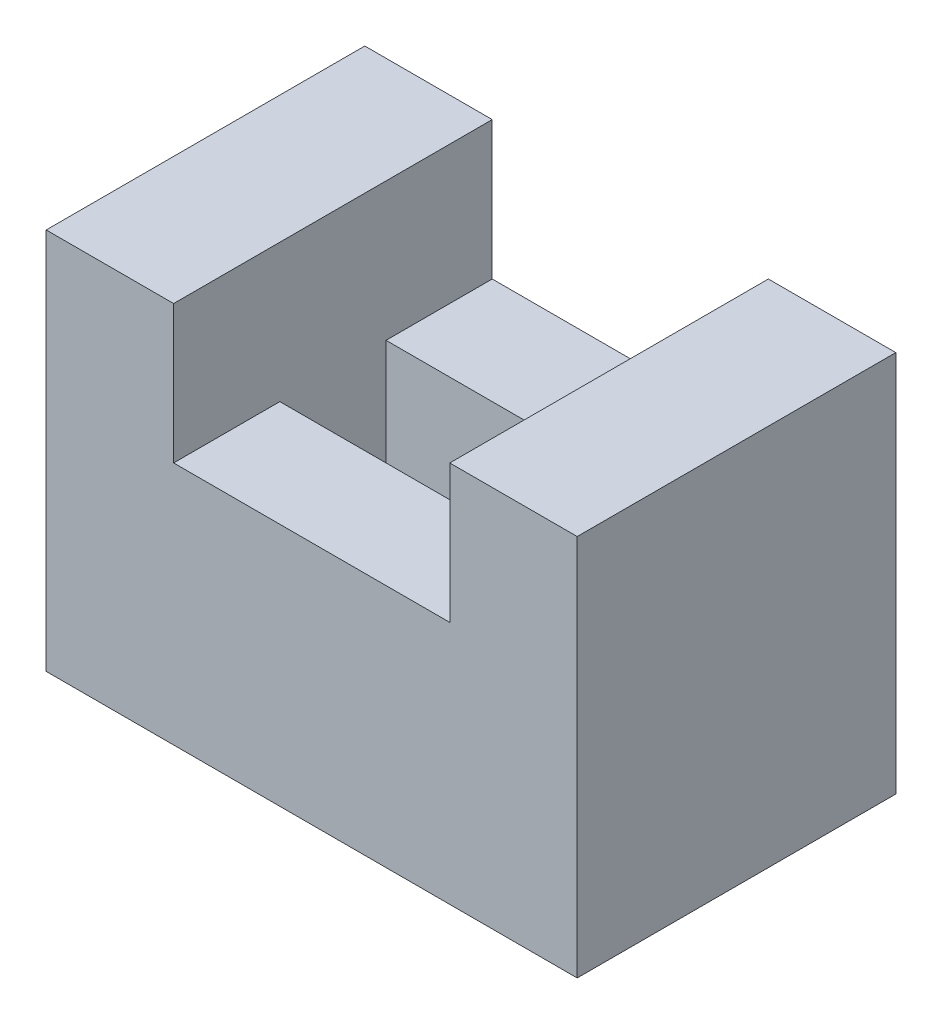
ISO-10303-21;
HEADER;
FILE_DESCRIPTION(('STEP AP214'),'2;1');
FILE_NAME('part.step','',(''),(''),'','','');
FILE_SCHEMA(('AUTOMOTIVE_DESIGN { 1 0 10303 214 1 1 1 1 }'));
ENDSEC;
DATA;
#1=APPLICATION_CONTEXT('core data for automotive mechanical design processes');
#2=APPLICATION_PROTOCOL_DEFINITION('international standard','automotive_design',2000,#1);
#3=PRODUCT_CONTEXT('',#1,'mechanical');
#4=PRODUCT('Part','Part','',(#3));
#5=PRODUCT_RELATED_PRODUCT_CATEGORY('part','',(#4));
#6=PRODUCT_DEFINITION_FORMATION('','',#4);
#7=PRODUCT_DEFINITION_CONTEXT('part definition',#1,'design');
#8=PRODUCT_DEFINITION('design','',#6,#7);
#9=PRODUCT_DEFINITION_SHAPE('','',#8);
#10=(LENGTH_UNIT() NAMED_UNIT(*) SI_UNIT(.MILLI.,.METRE.));
#11=(NAMED_UNIT(*) PLANE_ANGLE_UNIT() SI_UNIT($,.RADIAN.));
#12=(NAMED_UNIT(*) SI_UNIT($,.STERADIAN.) SOLID_ANGLE_UNIT());
#13=UNCERTAINTY_MEASURE_WITH_UNIT(LENGTH_MEASURE(1.E-05),#10,'distance_accuracy_value','');
#14=(GEOMETRIC_REPRESENTATION_CONTEXT(3) GLOBAL_UNCERTAINTY_ASSIGNED_CONTEXT((#13)) GLOBAL_UNIT_ASSIGNED_CONTEXT((#10,
#11,#12)) REPRESENTATION_CONTEXT('',''));
#15=CARTESIAN_POINT('',(0.,0.,0.));
#16=DIRECTION('',(0.,0.,1.));
#17=DIRECTION('',(1.,0.,0.));
#18=AXIS2_PLACEMENT_3D('',#15,#16,#17);
#19=CARTESIAN_POINT('',(26.,8.1221264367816,-60.));
#20=DIRECTION('',(0.,1.,0.));
#21=DIRECTION('',(0.,0.,1.));
#22=AXIS2_PLACEMENT_3D('',#19,#20,#21);
#23=PLANE('',#22);
#24=DIRECTION('',(-1.,0.,0.));
#25=VECTOR('',#24,1.);
#26=CARTESIAN_POINT('',(-26.,8.1221264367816,-40.));
#27=LINE('',#26,#25);
#28=CARTESIAN_POINT('',(26.,8.1221264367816,-40.));
#29=VERTEX_POINT('',#28);
#30=CARTESIAN_POINT('',(-26.,8.1221264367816,-40.));
#31=VERTEX_POINT('',#30);
#32=EDGE_CURVE('E140',#29,#31,#27,.T.);
#33=ORIENTED_EDGE('',*,*,#32,.F.);
#34=DIRECTION('',(0.,0.,1.));
#35=VECTOR('',#34,1.);
#36=CARTESIAN_POINT('',(26.,8.1221264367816,-60.));
#37=LINE('',#36,#35);
#38=CARTESIAN_POINT('',(26.,8.1221264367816,-60.));
#39=VERTEX_POINT('',#38);
#40=EDGE_CURVE('E205',#39,#29,#37,.T.);
#41=ORIENTED_EDGE('',*,*,#40,.F.);
#42=DIRECTION('',(-1.,0.,0.));
#43=VECTOR('',#42,1.);
#44=CARTESIAN_POINT('',(26.,8.1221264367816,-60.));
#45=LINE('',#44,#43);
#46=CARTESIAN_POINT('',(-26.,8.1221264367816,-60.));
#47=VERTEX_POINT('',#46);
#48=EDGE_CURVE('E170',#39,#47,#45,.T.);
#49=ORIENTED_EDGE('',*,*,#48,.T.);
#50=DIRECTION('',(0.,0.,1.));
#51=VECTOR('',#50,1.);
#52=CARTESIAN_POINT('',(-26.,8.1221264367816,-60.));
#53=LINE('',#52,#51);
#54=EDGE_CURVE('E202',#47,#31,#53,.T.);
#55=ORIENTED_EDGE('',*,*,#54,.T.);
#56=EDGE_LOOP('',(#33,#41,#49,#55));
#57=FACE_BOUND('',#56,.T.);
#58=ADVANCED_FACE('F31',(#57),#23,.T.);
#59=CARTESIAN_POINT('',(-50.,34.1221264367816,-60.));
#60=DIRECTION('',(-1.,0.,0.));
#61=DIRECTION('',(0.,-1.,0.));
#62=AXIS2_PLACEMENT_3D('',#59,#60,#61);
#63=PLANE('',#62);
#64=DIRECTION('',(0.,-1.,0.));
#65=VECTOR('',#64,1.);
#66=CARTESIAN_POINT('',(-50.,34.1221264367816,0.));
#67=LINE('',#66,#65);
#68=CARTESIAN_POINT('',(-50.,34.1221264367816,0.));
#69=VERTEX_POINT('',#68);
#70=CARTESIAN_POINT('',(-50.,-37.8778735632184,0.));
#71=VERTEX_POINT('',#70);
#72=EDGE_CURVE('E150',#69,#71,#67,.T.);
#73=ORIENTED_EDGE('',*,*,#72,.F.);
#74=DIRECTION('',(0.,0.,1.));
#75=VECTOR('',#74,1.);
#76=CARTESIAN_POINT('',(-50.,34.1221264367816,-60.));
#77=LINE('',#76,#75);
#78=CARTESIAN_POINT('',(-50.,34.1221264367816,-60.));
#79=VERTEX_POINT('',#78);
#80=EDGE_CURVE('E11',#79,#69,#77,.T.);
#81=ORIENTED_EDGE('',*,*,#80,.F.);
#82=DIRECTION('',(0.,-1.,0.));
#83=VECTOR('',#82,1.);
#84=CARTESIAN_POINT('',(-50.,34.1221264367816,-60.));
#85=LINE('',#84,#83);
#86=CARTESIAN_POINT('',(-50.,-37.8778735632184,-60.));
#87=VERTEX_POINT('',#86);
#88=EDGE_CURVE('E154',#79,#87,#85,.T.);
#89=ORIENTED_EDGE('',*,*,#88,.T.);
#90=DIRECTION('',(0.,0.,1.));
#91=VECTOR('',#90,1.);
#92=CARTESIAN_POINT('',(-50.,-37.8778735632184,-60.));
#93=LINE('',#92,#91);
#94=EDGE_CURVE('E35',#87,#71,#93,.T.);
#95=ORIENTED_EDGE('',*,*,#94,.T.);
#96=EDGE_LOOP('',(#73,#81,#89,#95));
#97=FACE_BOUND('',#96,.T.);
#98=ADVANCED_FACE('F33',(#97),#63,.T.);
#99=CARTESIAN_POINT('',(-26.,34.1221264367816,-60.));
#100=DIRECTION('',(0.,1.,0.));
#101=DIRECTION('',(-1.,0.,0.));
#102=AXIS2_PLACEMENT_3D('',#99,#100,#101);
#103=PLANE('',#102);
#104=DIRECTION('',(-1.,0.,0.));
#105=VECTOR('',#104,1.);
#106=CARTESIAN_POINT('',(-26.,34.1221264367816,0.));
#107=LINE('',#106,#105);
#108=CARTESIAN_POINT('',(-26.,34.1221264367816,0.));
#109=VERTEX_POINT('',#108);
#110=EDGE_CURVE('E158',#109,#69,#107,.T.);
#111=ORIENTED_EDGE('',*,*,#110,.F.);
#112=DIRECTION('',(0.,0.,1.));
#113=VECTOR('',#112,1.);
#114=CARTESIAN_POINT('',(-26.,34.1221264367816,-60.));
#115=LINE('',#114,#113);
#116=CARTESIAN_POINT('',(-26.,34.1221264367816,-60.));
#117=VERTEX_POINT('',#116);
#118=EDGE_CURVE('E40',#117,#109,#115,.T.);
#119=ORIENTED_EDGE('',*,*,#118,.F.);
#120=DIRECTION('',(-1.,0.,0.));
#121=VECTOR('',#120,1.);
#122=CARTESIAN_POINT('',(-26.,34.1221264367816,-60.));
#123=LINE('',#122,#121);
#124=EDGE_CURVE('E176',#117,#79,#123,.T.);
#125=ORIENTED_EDGE('',*,*,#124,.T.);
#126=ORIENTED_EDGE('',*,*,#80,.T.);
#127=EDGE_LOOP('',(#111,#119,#125,#126));
#128=FACE_BOUND('',#127,.T.);
#129=ADVANCED_FACE('F223',(#128),#103,.T.);
#130=CARTESIAN_POINT('',(-26.,8.1221264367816,-60.));
#131=DIRECTION('',(1.,0.,0.));
#132=DIRECTION('',(0.,1.,0.));
#133=AXIS2_PLACEMENT_3D('',#130,#131,#132);
#134=PLANE('',#133);
#135=DIRECTION('',(0.,1.,0.));
#136=VECTOR('',#135,1.);
#137=CARTESIAN_POINT('',(-26.,8.1221264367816,0.));
#138=LINE('',#137,#136);
#139=CARTESIAN_POINT('',(-26.,8.1221264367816,0.));
#140=VERTEX_POINT('',#139);
#141=EDGE_CURVE('E196',#140,#109,#138,.T.);
#142=ORIENTED_EDGE('',*,*,#141,.F.);
#143=CARTESIAN_POINT('',(-26.,8.1221264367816,-20.));
#144=VERTEX_POINT('',#143);
#145=EDGE_CURVE('E128',#144,#140,#53,.T.);
#146=ORIENTED_EDGE('',*,*,#145,.F.);
#147=DIRECTION('',(0.,1.,0.));
#148=VECTOR('',#147,1.);
#149=CARTESIAN_POINT('',(-26.,-37.8778735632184,-20.));
#150=LINE('',#149,#148);
#151=CARTESIAN_POINT('',(-26.,-37.8778735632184,-20.));
#152=VERTEX_POINT('',#151);
#153=EDGE_CURVE('E121',#152,#144,#150,.T.);
#154=ORIENTED_EDGE('',*,*,#153,.F.);
#155=DIRECTION('',(0.,0.,1.));
#156=VECTOR('',#155,1.);
#157=CARTESIAN_POINT('',(-26.,-37.8778735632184,-40.));
#158=LINE('',#157,#156);
#159=CARTESIAN_POINT('',(-26.,-37.8778735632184,-40.));
#160=VERTEX_POINT('',#159);
#161=EDGE_CURVE('E126',#160,#152,#158,.T.);
#162=ORIENTED_EDGE('',*,*,#161,.F.);
#163=DIRECTION('',(0.,1.,0.));
#164=VECTOR('',#163,1.);
#165=CARTESIAN_POINT('',(-26.,-37.8778735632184,-40.));
#166=LINE('',#165,#164);
#167=EDGE_CURVE('E148',#160,#31,#166,.T.);
#168=ORIENTED_EDGE('',*,*,#167,.T.);
#169=ORIENTED_EDGE('',*,*,#54,.F.);
#170=DIRECTION('',(0.,1.,0.));
#171=VECTOR('',#170,1.);
#172=CARTESIAN_POINT('',(-26.,8.1221264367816,-60.));
#173=LINE('',#172,#171);
#174=EDGE_CURVE('E173',#47,#117,#173,.T.);
#175=ORIENTED_EDGE('',*,*,#174,.T.);
#176=ORIENTED_EDGE('',*,*,#118,.T.);
#177=EDGE_LOOP('',(#142,#146,#154,#162,#168,#169,#175,#176));
#178=FACE_BOUND('',#177,.T.);
#179=ADVANCED_FACE('F124',(#178),#134,.T.);
#180=DIRECTION('',(1.,0.,0.));
#181=VECTOR('',#180,1.);
#182=CARTESIAN_POINT('',(-26.,8.1221264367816,-20.));
#183=LINE('',#182,#181);
#184=CARTESIAN_POINT('',(26.,8.1221264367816,-20.));
#185=VERTEX_POINT('',#184);
#186=EDGE_CURVE('E48',#144,#185,#183,.T.);
#187=ORIENTED_EDGE('',*,*,#186,.F.);
#188=ORIENTED_EDGE('',*,*,#145,.T.);
#189=DIRECTION('',(-1.,0.,0.));
#190=VECTOR('',#189,1.);
#191=CARTESIAN_POINT('',(26.,8.1221264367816,0.));
#192=LINE('',#191,#190);
#193=CARTESIAN_POINT('',(26.,8.1221264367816,0.));
#194=VERTEX_POINT('',#193);
#195=EDGE_CURVE('E193',#194,#140,#192,.T.);
#196=ORIENTED_EDGE('',*,*,#195,.F.);
#197=EDGE_CURVE('E208',#185,#194,#37,.T.);
#198=ORIENTED_EDGE('',*,*,#197,.F.);
#199=EDGE_LOOP('',(#187,#188,#196,#198));
#200=FACE_BOUND('',#199,.T.);
#201=ADVANCED_FACE('F241',(#200),#23,.T.);
#202=CARTESIAN_POINT('',(26.,34.1221264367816,-60.));
#203=DIRECTION('',(-1.,0.,0.));
#204=DIRECTION('',(0.,-1.,0.));
#205=AXIS2_PLACEMENT_3D('',#202,#203,#204);
#206=PLANE('',#205);
#207=DIRECTION('',(0.,-1.,0.));
#208=VECTOR('',#207,1.);
#209=CARTESIAN_POINT('',(26.,34.1221264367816,0.));
#210=LINE('',#209,#208);
#211=CARTESIAN_POINT('',(26.,34.1221264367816,0.));
#212=VERTEX_POINT('',#211);
#213=EDGE_CURVE('E190',#212,#194,#210,.T.);
#214=ORIENTED_EDGE('',*,*,#213,.F.);
#215=DIRECTION('',(0.,0.,1.));
#216=VECTOR('',#215,1.);
#217=CARTESIAN_POINT('',(26.,34.1221264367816,-60.));
#218=LINE('',#217,#216);
#219=CARTESIAN_POINT('',(26.,34.1221264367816,-60.));
#220=VERTEX_POINT('',#219);
#221=EDGE_CURVE('E209',#220,#212,#218,.T.);
#222=ORIENTED_EDGE('',*,*,#221,.F.);
#223=DIRECTION('',(0.,-1.,0.));
#224=VECTOR('',#223,1.);
#225=CARTESIAN_POINT('',(26.,34.1221264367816,-60.));
#226=LINE('',#225,#224);
#227=EDGE_CURVE('E167',#220,#39,#226,.T.);
#228=ORIENTED_EDGE('',*,*,#227,.T.);
#229=ORIENTED_EDGE('',*,*,#40,.T.);
#230=DIRECTION('',(0.,1.,0.));
#231=VECTOR('',#230,1.);
#232=CARTESIAN_POINT('',(26.,-37.8778735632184,-40.));
#233=LINE('',#232,#231);
#234=CARTESIAN_POINT('',(26.,-37.8778735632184,-40.));
#235=VERTEX_POINT('',#234);
#236=EDGE_CURVE('E151',#235,#29,#233,.T.);
#237=ORIENTED_EDGE('',*,*,#236,.F.);
#238=DIRECTION('',(0.,0.,-1.));
#239=VECTOR('',#238,1.);
#240=CARTESIAN_POINT('',(26.,-37.8778735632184,-40.));
#241=LINE('',#240,#239);
#242=CARTESIAN_POINT('',(26.,-37.8778735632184,-20.));
#243=VERTEX_POINT('',#242);
#244=EDGE_CURVE('E55',#243,#235,#241,.T.);
#245=ORIENTED_EDGE('',*,*,#244,.F.);
#246=DIRECTION('',(0.,1.,0.));
#247=VECTOR('',#246,1.);
#248=CARTESIAN_POINT('',(26.,-37.8778735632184,-20.));
#249=LINE('',#248,#247);
#250=EDGE_CURVE('E129',#243,#185,#249,.T.);
#251=ORIENTED_EDGE('',*,*,#250,.T.);
#252=ORIENTED_EDGE('',*,*,#197,.T.);
#253=EDGE_LOOP('',(#214,#222,#228,#229,#237,#245,#251,#252));
#254=FACE_BOUND('',#253,.T.);
#255=ADVANCED_FACE('F237',(#254),#206,.T.);
#256=CARTESIAN_POINT('',(50.,34.1221264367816,-60.));
#257=DIRECTION('',(0.,1.,0.));
#258=DIRECTION('',(0.,0.,1.));
#259=AXIS2_PLACEMENT_3D('',#256,#257,#258);
#260=PLANE('',#259);
#261=DIRECTION('',(-1.,0.,0.));
#262=VECTOR('',#261,1.);
#263=CARTESIAN_POINT('',(50.,34.1221264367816,0.));
#264=LINE('',#263,#262);
#265=CARTESIAN_POINT('',(50.,34.1221264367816,0.));
#266=VERTEX_POINT('',#265);
#267=EDGE_CURVE('E187',#266,#212,#264,.T.);
#268=ORIENTED_EDGE('',*,*,#267,.F.);
#269=DIRECTION('',(0.,0.,1.));
#270=VECTOR('',#269,1.);
#271=CARTESIAN_POINT('',(50.,34.1221264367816,-60.));
#272=LINE('',#271,#270);
#273=CARTESIAN_POINT('',(50.,34.1221264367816,-60.));
#274=VERTEX_POINT('',#273);
#275=EDGE_CURVE('E211',#274,#266,#272,.T.);
#276=ORIENTED_EDGE('',*,*,#275,.F.);
#277=DIRECTION('',(-1.,0.,0.));
#278=VECTOR('',#277,1.);
#279=CARTESIAN_POINT('',(50.,34.1221264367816,-60.));
#280=LINE('',#279,#278);
#281=EDGE_CURVE('E164',#274,#220,#280,.T.);
#282=ORIENTED_EDGE('',*,*,#281,.T.);
#283=ORIENTED_EDGE('',*,*,#221,.T.);
#284=EDGE_LOOP('',(#268,#276,#282,#283));
#285=FACE_BOUND('',#284,.T.);
#286=ADVANCED_FACE('F236',(#285),#260,.T.);
#287=CARTESIAN_POINT('',(50.,-37.8778735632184,-60.));
#288=DIRECTION('',(1.,0.,0.));
#289=DIRECTION('',(0.,1.,0.));
#290=AXIS2_PLACEMENT_3D('',#287,#288,#289);
#291=PLANE('',#290);
#292=DIRECTION('',(0.,1.,0.));
#293=VECTOR('',#292,1.);
#294=CARTESIAN_POINT('',(50.,-37.8778735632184,0.));
#295=LINE('',#294,#293);
#296=CARTESIAN_POINT('',(50.,-37.8778735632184,0.));
#297=VERTEX_POINT('',#296);
#298=EDGE_CURVE('E184',#297,#266,#295,.T.);
#299=ORIENTED_EDGE('',*,*,#298,.F.);
#300=DIRECTION('',(0.,0.,1.));
#301=VECTOR('',#300,1.);
#302=CARTESIAN_POINT('',(50.,-37.8778735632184,-60.));
#303=LINE('',#302,#301);
#304=CARTESIAN_POINT('',(50.,-37.8778735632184,-60.));
#305=VERTEX_POINT('',#304);
#306=EDGE_CURVE('E212',#305,#297,#303,.T.);
#307=ORIENTED_EDGE('',*,*,#306,.F.);
#308=DIRECTION('',(0.,1.,0.));
#309=VECTOR('',#308,1.);
#310=CARTESIAN_POINT('',(50.,-37.8778735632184,-60.));
#311=LINE('',#310,#309);
#312=EDGE_CURVE('E161',#305,#274,#311,.T.);
#313=ORIENTED_EDGE('',*,*,#312,.T.);
#314=ORIENTED_EDGE('',*,*,#275,.T.);
#315=EDGE_LOOP('',(#299,#307,#313,#314));
#316=FACE_BOUND('',#315,.T.);
#317=ADVANCED_FACE('F232',(#316),#291,.T.);
#318=CARTESIAN_POINT('',(-50.,-37.8778735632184,-60.));
#319=DIRECTION('',(0.,-1.,0.));
#320=DIRECTION('',(0.,0.,-1.));
#321=AXIS2_PLACEMENT_3D('',#318,#319,#320);
#322=PLANE('',#321);
#323=ORIENTED_EDGE('',*,*,#161,.T.);
#324=DIRECTION('',(1.,0.,0.));
#325=VECTOR('',#324,1.);
#326=CARTESIAN_POINT('',(-26.,-37.8778735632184,-20.));
#327=LINE('',#326,#325);
#328=EDGE_CURVE('E133',#152,#243,#327,.T.);
#329=ORIENTED_EDGE('',*,*,#328,.T.);
#330=ORIENTED_EDGE('',*,*,#244,.T.);
#331=DIRECTION('',(-1.,0.,0.));
#332=VECTOR('',#331,1.);
#333=CARTESIAN_POINT('',(-26.,-37.8778735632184,-40.));
#334=LINE('',#333,#332);
#335=EDGE_CURVE('E130',#235,#160,#334,.T.);
#336=ORIENTED_EDGE('',*,*,#335,.T.);
#337=EDGE_LOOP('',(#323,#329,#330,#336));
#338=FACE_BOUND('',#337,.T.);
#339=DIRECTION('',(1.,0.,0.));
#340=VECTOR('',#339,1.);
#341=CARTESIAN_POINT('',(-50.,-37.8778735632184,0.));
#342=LINE('',#341,#340);
#343=EDGE_CURVE('E181',#71,#297,#342,.T.);
#344=ORIENTED_EDGE('',*,*,#343,.F.);
#345=ORIENTED_EDGE('',*,*,#94,.F.);
#346=DIRECTION('',(1.,0.,0.));
#347=VECTOR('',#346,1.);
#348=CARTESIAN_POINT('',(-50.,-37.8778735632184,-60.));
#349=LINE('',#348,#347);
#350=EDGE_CURVE('E157',#87,#305,#349,.T.);
#351=ORIENTED_EDGE('',*,*,#350,.T.);
#352=ORIENTED_EDGE('',*,*,#306,.T.);
#353=EDGE_LOOP('',(#344,#345,#351,#352));
#354=FACE_BOUND('',#353,.T.);
#355=ADVANCED_FACE('F137',(#338,#354),#322,.T.);
#356=CARTESIAN_POINT('',(-50.,-37.8778735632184,-60.));
#357=DIRECTION('',(0.,0.,1.));
#358=DIRECTION('',(1.,0.,0.));
#359=AXIS2_PLACEMENT_3D('',#356,#357,#358);
#360=PLANE('',#359);
#361=ORIENTED_EDGE('',*,*,#88,.F.);
#362=ORIENTED_EDGE('',*,*,#124,.F.);
#363=ORIENTED_EDGE('',*,*,#174,.F.);
#364=ORIENTED_EDGE('',*,*,#48,.F.);
#365=ORIENTED_EDGE('',*,*,#227,.F.);
#366=ORIENTED_EDGE('',*,*,#281,.F.);
#367=ORIENTED_EDGE('',*,*,#312,.F.);
#368=ORIENTED_EDGE('',*,*,#350,.F.);
#369=EDGE_LOOP('',(#361,#362,#363,#364,#365,#366,#367,#368));
#370=FACE_BOUND('',#369,.T.);
#371=ADVANCED_FACE('F226',(#370),#360,.F.);
#372=CARTESIAN_POINT('',(-50.,-37.8778735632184,0.));
#373=DIRECTION('',(0.,0.,1.));
#374=DIRECTION('',(1.,0.,0.));
#375=AXIS2_PLACEMENT_3D('',#372,#373,#374);
#376=PLANE('',#375);
#377=ORIENTED_EDGE('',*,*,#72,.T.);
#378=ORIENTED_EDGE('',*,*,#343,.T.);
#379=ORIENTED_EDGE('',*,*,#298,.T.);
#380=ORIENTED_EDGE('',*,*,#267,.T.);
#381=ORIENTED_EDGE('',*,*,#213,.T.);
#382=ORIENTED_EDGE('',*,*,#195,.T.);
#383=ORIENTED_EDGE('',*,*,#141,.T.);
#384=ORIENTED_EDGE('',*,*,#110,.T.);
#385=EDGE_LOOP('',(#377,#378,#379,#380,#381,#382,#383,#384));
#386=FACE_BOUND('',#385,.T.);
#387=ADVANCED_FACE('F220',(#386),#376,.T.);
#388=CARTESIAN_POINT('',(-26.,-37.8778735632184,-40.));
#389=DIRECTION('',(0.,0.,-1.));
#390=DIRECTION('',(-1.,0.,0.));
#391=AXIS2_PLACEMENT_3D('',#388,#389,#390);
#392=PLANE('',#391);
#393=ORIENTED_EDGE('',*,*,#32,.T.);
#394=ORIENTED_EDGE('',*,*,#167,.F.);
#395=ORIENTED_EDGE('',*,*,#335,.F.);
#396=ORIENTED_EDGE('',*,*,#236,.T.);
#397=EDGE_LOOP('',(#393,#394,#395,#396));
#398=FACE_BOUND('',#397,.T.);
#399=ADVANCED_FACE('F246',(#398),#392,.F.);
#400=CARTESIAN_POINT('',(-26.,-37.8778735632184,-20.));
#401=DIRECTION('',(0.,0.,1.));
#402=DIRECTION('',(1.,0.,0.));
#403=AXIS2_PLACEMENT_3D('',#400,#401,#402);
#404=PLANE('',#403);
#405=ORIENTED_EDGE('',*,*,#186,.T.);
#406=ORIENTED_EDGE('',*,*,#250,.F.);
#407=ORIENTED_EDGE('',*,*,#328,.F.);
#408=ORIENTED_EDGE('',*,*,#153,.T.);
#409=EDGE_LOOP('',(#405,#406,#407,#408));
#410=FACE_BOUND('',#409,.T.);
#411=ADVANCED_FACE('F134',(#410),#404,.F.);
#412=CLOSED_SHELL('',(#58,#98,#129,#179,#201,#255,#286,#317,#355,#371,#387,#399,#411));
#413=MANIFOLD_SOLID_BREP('B2',#412);
#414=ADVANCED_BREP_SHAPE_REPRESENTATION('',(#18,#413),#14);
#415=SHAPE_DEFINITION_REPRESENTATION(#9,#414);
ENDSEC;
END-ISO-10303-21;
